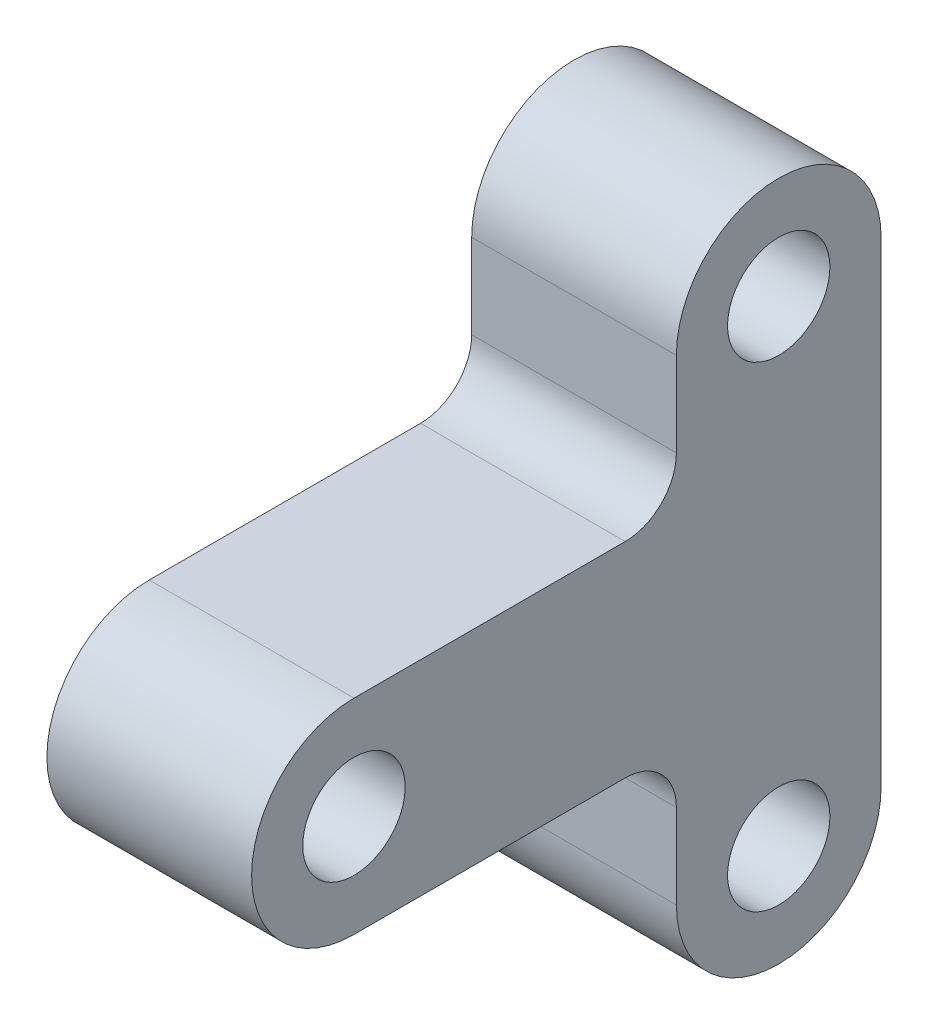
from build123d import *

# Parameters (mm, degrees)
SKETCH1_R      = 5
EXTRUDE1_DEPTH = 10


with BuildPart() as part:
    # Sketch1 → Extrude1 (new, symmetric)
    with BuildSketch(Plane(origin=(0, 0, 0), x_dir=(0, 0, -1), z_dir=(1, 0, 0))):
        with BuildLine():
            Line((10, 0), (10, 8.25))
            Line((10, 8.25), (10, 38.25))
            Line((10, 38.25), (10, 46.5))
            ThreePointArc((10, 46.5), (0, 56.5), (-10, 46.5))
            Line((-10, 46.5), (-10, 38.25))
            ThreePointArc((-10, 38.25), (-11.464466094, 34.714466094), (-15, 33.25))
            Line((-15, 33.25), (-41.5, 33.25))
            ThreePointArc((-41.5, 33.25), (-51.5, 23.25), (-41.5, 13.25))
            Line((-41.5, 13.25), (-15, 13.25))
            ThreePointArc((-15, 13.25), (-11.464466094, 11.785533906), (-10, 8.25))
            Line((-10, 8.25), (-10, 0))
            ThreePointArc((-10, 0), (0, -10), (10, 0))
        make_face()
        with Locations((0, 46.5)):
            Circle(SKETCH1_R, mode=Mode.SUBTRACT)
        Circle(SKETCH1_R, mode=Mode.SUBTRACT)
        with Locations(Location((-41.5, 23.25, 0), (0, 0, 180))):
            Circle(SKETCH1_R, mode=Mode.SUBTRACT)
    extrude(amount=EXTRUDE1_DEPTH, both=True)


solid = part.part
